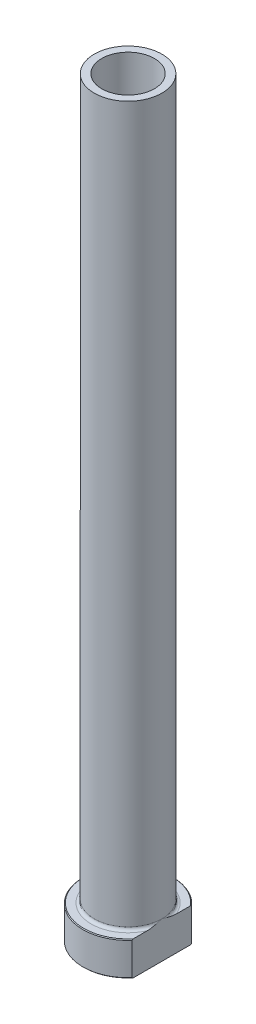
from build123d import *

# Parameters (mm, degrees)
FILLET1_R          = 0.8
CHAMFER1_SIZE      = 0.2
CUT_EXTRUDE1_DEPTH = 201.718708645
CHAMFER2_SIZE      = 0.5


with BuildPart() as part:
    # Sketch1 → Revolve1 (revolve)
    with BuildSketch(Plane.XY, mode=Mode.PRIVATE) as revolve1_sk:
        Polygon((-7, 200), (-9, 200), (-9, 9), (-12, 9), (-12, 0), (-7.25, 0), (-7.25, 133), (-7, 145), align=None)
    revolve(revolve1_sk.sketch.rotate(Axis((0, 92.187680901, 0), (0, -1, 0)), 270), axis=Axis((0, 92.187680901, 0), (0, -1, 0)))

    # Fillet1
    fillet1_edges = [part.edges().sort_by_distance(p)[0] for p in [
        (0, 9, -9),
    ]]
    fillet(fillet1_edges, radius=FILLET1_R)

    # Chamfer1
    chamfer1_edges = [part.edges().sort_by_distance(p)[0] for p in [
        (0, 0, -12),
        (0, 9, -12),
    ]]
    chamfer(chamfer1_edges, length=CHAMFER1_SIZE)

    # Sketch2 → Cut-Extrude1 (cut, through all)
    with BuildSketch(Plane.XZ):
        with BuildLine():
            Line((9, 7.937253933), (9, -7.937253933))
            ThreePointArc((9, -7.937253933), (12, 0), (9, 7.937253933))
        make_face()
    extrude(amount=-CUT_EXTRUDE1_DEPTH, mode=Mode.SUBTRACT)

    # Chamfer2
    chamfer2_edges = [part.edges().sort_by_distance(p)[0] for p in [
        (0, 0, -7.25),
    ]]
    chamfer(chamfer2_edges, length=CHAMFER2_SIZE)


solid = part.part
